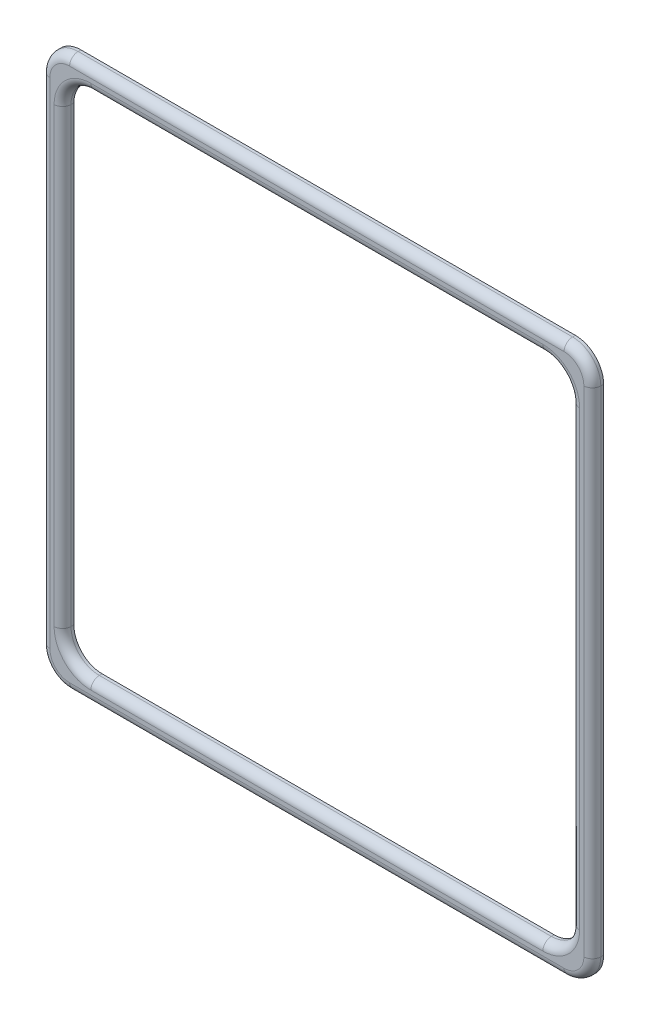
ISO-10303-21;
HEADER;
FILE_DESCRIPTION(('STEP AP214'),'2;1');
FILE_NAME('part.step','',(''),(''),'','','');
FILE_SCHEMA(('AUTOMOTIVE_DESIGN { 1 0 10303 214 1 1 1 1 }'));
ENDSEC;
DATA;
#1=APPLICATION_CONTEXT('core data for automotive mechanical design processes');
#2=APPLICATION_PROTOCOL_DEFINITION('international standard','automotive_design',2000,#1);
#3=PRODUCT_CONTEXT('',#1,'mechanical');
#4=PRODUCT('Part','Part','',(#3));
#5=PRODUCT_RELATED_PRODUCT_CATEGORY('part','',(#4));
#6=PRODUCT_DEFINITION_FORMATION('','',#4);
#7=PRODUCT_DEFINITION_CONTEXT('part definition',#1,'design');
#8=PRODUCT_DEFINITION('design','',#6,#7);
#9=PRODUCT_DEFINITION_SHAPE('','',#8);
#10=(LENGTH_UNIT() NAMED_UNIT(*) SI_UNIT(.MILLI.,.METRE.));
#11=(NAMED_UNIT(*) PLANE_ANGLE_UNIT() SI_UNIT($,.RADIAN.));
#12=(NAMED_UNIT(*) SI_UNIT($,.STERADIAN.) SOLID_ANGLE_UNIT());
#13=UNCERTAINTY_MEASURE_WITH_UNIT(LENGTH_MEASURE(1.E-05),#10,'distance_accuracy_value','');
#14=(GEOMETRIC_REPRESENTATION_CONTEXT(3) GLOBAL_UNCERTAINTY_ASSIGNED_CONTEXT((#13)) GLOBAL_UNIT_ASSIGNED_CONTEXT((#10,
#11,#12)) REPRESENTATION_CONTEXT('',''));
#15=CARTESIAN_POINT('',(0.,0.,0.));
#16=DIRECTION('',(0.,0.,1.));
#17=DIRECTION('',(1.,0.,0.));
#18=AXIS2_PLACEMENT_3D('',#15,#16,#17);
#19=CARTESIAN_POINT('',(20.,370.,8.));
#20=DIRECTION('',(0.,0.,-1.));
#21=DIRECTION('',(-1.,0.,0.));
#22=AXIS2_PLACEMENT_3D('',#19,#20,#21);
#23=PLANE('',#22);
#24=CARTESIAN_POINT('',(355.,35.,8.));
#25=DIRECTION('',(0.,0.,-1.));
#26=DIRECTION('',(-1.,0.,0.));
#27=AXIS2_PLACEMENT_3D('',#24,#25,#26);
#28=CIRCLE('',#27,26.);
#29=CARTESIAN_POINT('',(381.,35.,8.));
#30=VERTEX_POINT('',#29);
#31=CARTESIAN_POINT('',(355.,8.99999999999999,8.));
#32=VERTEX_POINT('',#31);
#33=EDGE_CURVE('E331',#30,#32,#28,.T.);
#34=ORIENTED_EDGE('',*,*,#33,.T.);
#35=DIRECTION('',(1.,0.,0.));
#36=VECTOR('',#35,1.);
#37=CARTESIAN_POINT('',(35.0000000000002,9.,8.));
#38=LINE('',#37,#36);
#39=CARTESIAN_POINT('',(35.0000000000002,9.,8.));
#40=VERTEX_POINT('',#39);
#41=EDGE_CURVE('E333',#32,#40,#38,.F.);
#42=ORIENTED_EDGE('',*,*,#41,.T.);
#43=CARTESIAN_POINT('',(35.0000000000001,35.,8.));
#44=DIRECTION('',(0.,0.,-1.));
#45=DIRECTION('',(-1.,0.,0.));
#46=AXIS2_PLACEMENT_3D('',#43,#44,#45);
#47=CIRCLE('',#46,26.);
#48=CARTESIAN_POINT('',(9.00000000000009,35.0000000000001,8.));
#49=VERTEX_POINT('',#48);
#50=EDGE_CURVE('E319',#40,#49,#47,.T.);
#51=ORIENTED_EDGE('',*,*,#50,.T.);
#52=DIRECTION('',(0.,-1.,0.));
#53=VECTOR('',#52,1.);
#54=CARTESIAN_POINT('',(9.,355.,8.));
#55=LINE('',#54,#53);
#56=CARTESIAN_POINT('',(9.,355.,8.));
#57=VERTEX_POINT('',#56);
#58=EDGE_CURVE('E321',#49,#57,#55,.F.);
#59=ORIENTED_EDGE('',*,*,#58,.T.);
#60=CARTESIAN_POINT('',(35.,355.,8.));
#61=DIRECTION('',(0.,0.,-1.));
#62=DIRECTION('',(-1.,0.,0.));
#63=AXIS2_PLACEMENT_3D('',#60,#61,#62);
#64=CIRCLE('',#63,26.);
#65=CARTESIAN_POINT('',(35.,381.,8.));
#66=VERTEX_POINT('',#65);
#67=EDGE_CURVE('E323',#57,#66,#64,.T.);
#68=ORIENTED_EDGE('',*,*,#67,.T.);
#69=DIRECTION('',(-1.,0.,0.));
#70=VECTOR('',#69,1.);
#71=CARTESIAN_POINT('',(355.,381.,8.));
#72=LINE('',#71,#70);
#73=CARTESIAN_POINT('',(355.,381.,8.));
#74=VERTEX_POINT('',#73);
#75=EDGE_CURVE('E325',#66,#74,#72,.F.);
#76=ORIENTED_EDGE('',*,*,#75,.T.);
#77=CARTESIAN_POINT('',(355.,355.,8.));
#78=DIRECTION('',(0.,0.,-1.));
#79=DIRECTION('',(-1.,0.,0.));
#80=AXIS2_PLACEMENT_3D('',#77,#78,#79);
#81=CIRCLE('',#80,26.);
#82=CARTESIAN_POINT('',(381.,355.,8.));
#83=VERTEX_POINT('',#82);
#84=EDGE_CURVE('E327',#74,#83,#81,.T.);
#85=ORIENTED_EDGE('',*,*,#84,.T.);
#86=DIRECTION('',(0.,1.,0.));
#87=VECTOR('',#86,1.);
#88=CARTESIAN_POINT('',(381.,35.,8.));
#89=LINE('',#88,#87);
#90=EDGE_CURVE('E329',#83,#30,#89,.F.);
#91=ORIENTED_EDGE('',*,*,#90,.T.);
#92=EDGE_LOOP('',(#34,#42,#51,#59,#68,#76,#85,#91));
#93=FACE_BOUND('',#92,.T.);
#94=CARTESIAN_POINT('',(370.,370.,8.));
#95=DIRECTION('',(0.,0.,-1.));
#96=DIRECTION('',(-1.,0.,0.));
#97=AXIS2_PLACEMENT_3D('',#94,#95,#96);
#98=CIRCLE('',#97,14.);
#99=CARTESIAN_POINT('',(384.,370.,8.));
#100=VERTEX_POINT('',#99);
#101=CARTESIAN_POINT('',(370.,384.,8.));
#102=VERTEX_POINT('',#101);
#103=EDGE_CURVE('E314',#100,#102,#98,.F.);
#104=ORIENTED_EDGE('',*,*,#103,.T.);
#105=DIRECTION('',(-1.,0.,0.));
#106=VECTOR('',#105,1.);
#107=CARTESIAN_POINT('',(20.,384.,8.));
#108=LINE('',#107,#106);
#109=CARTESIAN_POINT('',(20.,384.,8.));
#110=VERTEX_POINT('',#109);
#111=EDGE_CURVE('E316',#102,#110,#108,.T.);
#112=ORIENTED_EDGE('',*,*,#111,.T.);
#113=CARTESIAN_POINT('',(20.,370.,8.));
#114=DIRECTION('',(0.,0.,-1.));
#115=DIRECTION('',(-1.,0.,0.));
#116=AXIS2_PLACEMENT_3D('',#113,#114,#115);
#117=CIRCLE('',#116,14.);
#118=CARTESIAN_POINT('',(5.99999999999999,370.,8.));
#119=VERTEX_POINT('',#118);
#120=EDGE_CURVE('E302',#110,#119,#117,.F.);
#121=ORIENTED_EDGE('',*,*,#120,.T.);
#122=DIRECTION('',(0.,-1.,0.));
#123=VECTOR('',#122,1.);
#124=CARTESIAN_POINT('',(6.,370.,8.));
#125=LINE('',#124,#123);
#126=CARTESIAN_POINT('',(6.,20.0000000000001,8.));
#127=VERTEX_POINT('',#126);
#128=EDGE_CURVE('E304',#119,#127,#125,.T.);
#129=ORIENTED_EDGE('',*,*,#128,.T.);
#130=CARTESIAN_POINT('',(20.,20.,8.));
#131=DIRECTION('',(0.,0.,-1.));
#132=DIRECTION('',(-1.,0.,0.));
#133=AXIS2_PLACEMENT_3D('',#130,#131,#132);
#134=CIRCLE('',#133,14.);
#135=CARTESIAN_POINT('',(20.0000000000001,6.,8.));
#136=VERTEX_POINT('',#135);
#137=EDGE_CURVE('E306',#127,#136,#134,.F.);
#138=ORIENTED_EDGE('',*,*,#137,.T.);
#139=DIRECTION('',(1.,0.,0.));
#140=VECTOR('',#139,1.);
#141=CARTESIAN_POINT('',(20.,6.00000000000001,8.));
#142=LINE('',#141,#140);
#143=CARTESIAN_POINT('',(370.,6.00000000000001,8.));
#144=VERTEX_POINT('',#143);
#145=EDGE_CURVE('E308',#136,#144,#142,.T.);
#146=ORIENTED_EDGE('',*,*,#145,.T.);
#147=CARTESIAN_POINT('',(370.,20.,8.));
#148=DIRECTION('',(0.,0.,-1.));
#149=DIRECTION('',(-1.,0.,0.));
#150=AXIS2_PLACEMENT_3D('',#147,#148,#149);
#151=CIRCLE('',#150,14.);
#152=CARTESIAN_POINT('',(384.,20.,8.));
#153=VERTEX_POINT('',#152);
#154=EDGE_CURVE('E310',#144,#153,#151,.F.);
#155=ORIENTED_EDGE('',*,*,#154,.T.);
#156=DIRECTION('',(0.,1.,0.));
#157=VECTOR('',#156,1.);
#158=CARTESIAN_POINT('',(384.,370.,8.));
#159=LINE('',#158,#157);
#160=EDGE_CURVE('E312',#153,#100,#159,.T.);
#161=ORIENTED_EDGE('',*,*,#160,.T.);
#162=EDGE_LOOP('',(#104,#112,#121,#129,#138,#146,#155,#161));
#163=FACE_BOUND('',#162,.T.);
#164=ADVANCED_FACE('F39',(#93,#163),#23,.F.);
#165=CARTESIAN_POINT('',(20.,370.,0.));
#166=DIRECTION('',(0.,0.,-1.));
#167=DIRECTION('',(-1.,0.,0.));
#168=AXIS2_PLACEMENT_3D('',#165,#166,#167);
#169=PLANE('',#168);
#170=CARTESIAN_POINT('',(20.,370.,0.));
#171=DIRECTION('',(0.,0.,1.));
#172=DIRECTION('',(-1.,0.,0.));
#173=AXIS2_PLACEMENT_3D('',#170,#171,#172);
#174=CIRCLE('',#173,20.);
#175=CARTESIAN_POINT('',(20.,390.,0.));
#176=VERTEX_POINT('',#175);
#177=CARTESIAN_POINT('',(0.,370.,0.));
#178=VERTEX_POINT('',#177);
#179=EDGE_CURVE('E213',#176,#178,#174,.T.);
#180=ORIENTED_EDGE('',*,*,#179,.F.);
#181=DIRECTION('',(-1.,0.,0.));
#182=VECTOR('',#181,1.);
#183=CARTESIAN_POINT('',(20.,390.,0.));
#184=LINE('',#183,#182);
#185=CARTESIAN_POINT('',(370.,390.,0.));
#186=VERTEX_POINT('',#185);
#187=EDGE_CURVE('E281',#186,#176,#184,.T.);
#188=ORIENTED_EDGE('',*,*,#187,.F.);
#189=CARTESIAN_POINT('',(370.,370.,0.));
#190=DIRECTION('',(0.,0.,1.));
#191=DIRECTION('',(-1.,0.,0.));
#192=AXIS2_PLACEMENT_3D('',#189,#190,#191);
#193=CIRCLE('',#192,20.);
#194=CARTESIAN_POINT('',(390.,370.,0.));
#195=VERTEX_POINT('',#194);
#196=EDGE_CURVE('E278',#195,#186,#193,.T.);
#197=ORIENTED_EDGE('',*,*,#196,.F.);
#198=DIRECTION('',(0.,1.,0.));
#199=VECTOR('',#198,1.);
#200=CARTESIAN_POINT('',(390.,20.,0.));
#201=LINE('',#200,#199);
#202=CARTESIAN_POINT('',(390.,20.,0.));
#203=VERTEX_POINT('',#202);
#204=EDGE_CURVE('E275',#203,#195,#201,.T.);
#205=ORIENTED_EDGE('',*,*,#204,.F.);
#206=CARTESIAN_POINT('',(370.,20.,0.));
#207=DIRECTION('',(0.,0.,1.));
#208=DIRECTION('',(1.,0.,0.));
#209=AXIS2_PLACEMENT_3D('',#206,#207,#208);
#210=CIRCLE('',#209,20.);
#211=CARTESIAN_POINT('',(370.,0.,0.));
#212=VERTEX_POINT('',#211);
#213=EDGE_CURVE('E272',#212,#203,#210,.T.);
#214=ORIENTED_EDGE('',*,*,#213,.F.);
#215=DIRECTION('',(1.,0.,0.));
#216=VECTOR('',#215,1.);
#217=CARTESIAN_POINT('',(20.0000000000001,0.,0.));
#218=LINE('',#217,#216);
#219=CARTESIAN_POINT('',(20.0000000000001,0.,0.));
#220=VERTEX_POINT('',#219);
#221=EDGE_CURVE('E269',#220,#212,#218,.T.);
#222=ORIENTED_EDGE('',*,*,#221,.F.);
#223=CARTESIAN_POINT('',(20.,20.,0.));
#224=DIRECTION('',(0.,0.,1.));
#225=DIRECTION('',(-1.,0.,0.));
#226=AXIS2_PLACEMENT_3D('',#223,#224,#225);
#227=CIRCLE('',#226,20.);
#228=CARTESIAN_POINT('',(0.,20.0000000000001,0.));
#229=VERTEX_POINT('',#228);
#230=EDGE_CURVE('E266',#229,#220,#227,.T.);
#231=ORIENTED_EDGE('',*,*,#230,.F.);
#232=DIRECTION('',(0.,-1.,0.));
#233=VECTOR('',#232,1.);
#234=CARTESIAN_POINT('',(0.,20.0000000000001,0.));
#235=LINE('',#234,#233);
#236=EDGE_CURVE('E263',#178,#229,#235,.T.);
#237=ORIENTED_EDGE('',*,*,#236,.F.);
#238=EDGE_LOOP('',(#180,#188,#197,#205,#214,#222,#231,#237));
#239=FACE_BOUND('',#238,.T.);
#240=DIRECTION('',(0.,-1.,0.));
#241=VECTOR('',#240,1.);
#242=CARTESIAN_POINT('',(15.,355.,0.));
#243=LINE('',#242,#241);
#244=CARTESIAN_POINT('',(15.,355.,0.));
#245=VERTEX_POINT('',#244);
#246=CARTESIAN_POINT('',(15.0000000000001,35.0000000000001,0.));
#247=VERTEX_POINT('',#246);
#248=EDGE_CURVE('E228',#245,#247,#243,.T.);
#249=ORIENTED_EDGE('',*,*,#248,.T.);
#250=CARTESIAN_POINT('',(35.0000000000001,35.,0.));
#251=DIRECTION('',(0.,0.,1.));
#252=DIRECTION('',(1.,0.,0.));
#253=AXIS2_PLACEMENT_3D('',#250,#251,#252);
#254=CIRCLE('',#253,20.);
#255=CARTESIAN_POINT('',(35.0000000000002,15.,0.));
#256=VERTEX_POINT('',#255);
#257=EDGE_CURVE('E206',#247,#256,#254,.T.);
#258=ORIENTED_EDGE('',*,*,#257,.T.);
#259=DIRECTION('',(1.,0.,0.));
#260=VECTOR('',#259,1.);
#261=CARTESIAN_POINT('',(35.0000000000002,15.,0.));
#262=LINE('',#261,#260);
#263=CARTESIAN_POINT('',(355.,15.,0.));
#264=VERTEX_POINT('',#263);
#265=EDGE_CURVE('E217',#256,#264,#262,.T.);
#266=ORIENTED_EDGE('',*,*,#265,.T.);
#267=CARTESIAN_POINT('',(355.,35.,0.));
#268=DIRECTION('',(0.,0.,1.));
#269=DIRECTION('',(1.,0.,0.));
#270=AXIS2_PLACEMENT_3D('',#267,#268,#269);
#271=CIRCLE('',#270,20.);
#272=CARTESIAN_POINT('',(375.,35.,0.));
#273=VERTEX_POINT('',#272);
#274=EDGE_CURVE('E223',#264,#273,#271,.T.);
#275=ORIENTED_EDGE('',*,*,#274,.T.);
#276=DIRECTION('',(0.,1.,0.));
#277=VECTOR('',#276,1.);
#278=CARTESIAN_POINT('',(375.,355.,0.));
#279=LINE('',#278,#277);
#280=CARTESIAN_POINT('',(375.,355.,0.));
#281=VERTEX_POINT('',#280);
#282=EDGE_CURVE('E236',#273,#281,#279,.T.);
#283=ORIENTED_EDGE('',*,*,#282,.T.);
#284=CARTESIAN_POINT('',(355.,355.,0.));
#285=DIRECTION('',(0.,0.,1.));
#286=DIRECTION('',(-1.,0.,0.));
#287=AXIS2_PLACEMENT_3D('',#284,#285,#286);
#288=CIRCLE('',#287,20.);
#289=CARTESIAN_POINT('',(355.,375.,0.));
#290=VERTEX_POINT('',#289);
#291=EDGE_CURVE('E239',#281,#290,#288,.T.);
#292=ORIENTED_EDGE('',*,*,#291,.T.);
#293=DIRECTION('',(-1.,0.,0.));
#294=VECTOR('',#293,1.);
#295=CARTESIAN_POINT('',(35.,375.,0.));
#296=LINE('',#295,#294);
#297=CARTESIAN_POINT('',(35.,375.,0.));
#298=VERTEX_POINT('',#297);
#299=EDGE_CURVE('E242',#290,#298,#296,.T.);
#300=ORIENTED_EDGE('',*,*,#299,.T.);
#301=CARTESIAN_POINT('',(35.,355.,0.));
#302=DIRECTION('',(0.,0.,1.));
#303=DIRECTION('',(1.,0.,0.));
#304=AXIS2_PLACEMENT_3D('',#301,#302,#303);
#305=CIRCLE('',#304,20.);
#306=EDGE_CURVE('E245',#298,#245,#305,.T.);
#307=ORIENTED_EDGE('',*,*,#306,.T.);
#308=EDGE_LOOP('',(#249,#258,#266,#275,#283,#292,#300,#307));
#309=FACE_BOUND('',#308,.T.);
#310=ADVANCED_FACE('F225',(#239,#309),#169,.T.);
#311=CARTESIAN_POINT('',(20.,370.,8.));
#312=DIRECTION('',(0.,0.,-1.));
#313=DIRECTION('',(-1.,0.,0.));
#314=AXIS2_PLACEMENT_3D('',#311,#312,#313);
#315=CYLINDRICAL_SURFACE('',#314,20.);
#316=DIRECTION('',(0.,0.,-1.));
#317=VECTOR('',#316,1.);
#318=CARTESIAN_POINT('',(0.,370.,8.));
#319=LINE('',#318,#317);
#320=CARTESIAN_POINT('',(0.,370.,2.));
#321=VERTEX_POINT('',#320);
#322=EDGE_CURVE('E298',#321,#178,#319,.T.);
#323=ORIENTED_EDGE('',*,*,#322,.F.);
#324=CARTESIAN_POINT('',(20.,370.,2.));
#325=DIRECTION('',(0.,0.,-1.));
#326=DIRECTION('',(-1.,0.,0.));
#327=AXIS2_PLACEMENT_3D('',#324,#325,#326);
#328=CIRCLE('',#327,20.);
#329=CARTESIAN_POINT('',(20.,390.,2.));
#330=VERTEX_POINT('',#329);
#331=EDGE_CURVE('E11',#321,#330,#328,.T.);
#332=ORIENTED_EDGE('',*,*,#331,.T.);
#333=DIRECTION('',(0.,0.,-1.));
#334=VECTOR('',#333,1.);
#335=CARTESIAN_POINT('',(20.,390.,8.));
#336=LINE('',#335,#334);
#337=EDGE_CURVE('E284',#330,#176,#336,.T.);
#338=ORIENTED_EDGE('',*,*,#337,.T.);
#339=ORIENTED_EDGE('',*,*,#179,.T.);
#340=EDGE_LOOP('',(#323,#332,#338,#339));
#341=FACE_BOUND('',#340,.T.);
#342=ADVANCED_FACE('F453',(#341),#315,.T.);
#343=CARTESIAN_POINT('',(0.,20.0000000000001,8.));
#344=DIRECTION('',(1.,0.,0.));
#345=DIRECTION('',(0.,0.,-1.));
#346=AXIS2_PLACEMENT_3D('',#343,#344,#345);
#347=PLANE('',#346);
#348=DIRECTION('',(0.,0.,-1.));
#349=VECTOR('',#348,1.);
#350=CARTESIAN_POINT('',(0.,20.0000000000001,8.));
#351=LINE('',#350,#349);
#352=CARTESIAN_POINT('',(0.,20.0000000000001,2.));
#353=VERTEX_POINT('',#352);
#354=EDGE_CURVE('E296',#353,#229,#351,.T.);
#355=ORIENTED_EDGE('',*,*,#354,.F.);
#356=DIRECTION('',(0.,-1.,0.));
#357=VECTOR('',#356,1.);
#358=CARTESIAN_POINT('',(0.,20.0000000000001,2.));
#359=LINE('',#358,#357);
#360=EDGE_CURVE('E48',#353,#321,#359,.F.);
#361=ORIENTED_EDGE('',*,*,#360,.T.);
#362=ORIENTED_EDGE('',*,*,#322,.T.);
#363=ORIENTED_EDGE('',*,*,#236,.T.);
#364=EDGE_LOOP('',(#355,#361,#362,#363));
#365=FACE_BOUND('',#364,.T.);
#366=ADVANCED_FACE('F493',(#365),#347,.F.);
#367=CARTESIAN_POINT('',(20.,20.,8.));
#368=DIRECTION('',(0.,0.,-1.));
#369=DIRECTION('',(-1.,0.,0.));
#370=AXIS2_PLACEMENT_3D('',#367,#368,#369);
#371=CYLINDRICAL_SURFACE('',#370,20.);
#372=DIRECTION('',(0.,0.,-1.));
#373=VECTOR('',#372,1.);
#374=CARTESIAN_POINT('',(20.0000000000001,0.,8.));
#375=LINE('',#374,#373);
#376=CARTESIAN_POINT('',(20.0000000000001,0.,2.));
#377=VERTEX_POINT('',#376);
#378=EDGE_CURVE('E294',#377,#220,#375,.T.);
#379=ORIENTED_EDGE('',*,*,#378,.F.);
#380=CARTESIAN_POINT('',(20.,20.,2.));
#381=DIRECTION('',(0.,0.,-1.));
#382=DIRECTION('',(-1.,0.,0.));
#383=AXIS2_PLACEMENT_3D('',#380,#381,#382);
#384=CIRCLE('',#383,20.);
#385=EDGE_CURVE('E63',#377,#353,#384,.T.);
#386=ORIENTED_EDGE('',*,*,#385,.T.);
#387=ORIENTED_EDGE('',*,*,#354,.T.);
#388=ORIENTED_EDGE('',*,*,#230,.T.);
#389=EDGE_LOOP('',(#379,#386,#387,#388));
#390=FACE_BOUND('',#389,.T.);
#391=ADVANCED_FACE('F413',(#390),#371,.T.);
#392=CARTESIAN_POINT('',(20.0000000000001,0.,8.));
#393=DIRECTION('',(0.,1.,0.));
#394=DIRECTION('',(0.,0.,1.));
#395=AXIS2_PLACEMENT_3D('',#392,#393,#394);
#396=PLANE('',#395);
#397=DIRECTION('',(0.,0.,-1.));
#398=VECTOR('',#397,1.);
#399=CARTESIAN_POINT('',(370.,0.,8.));
#400=LINE('',#399,#398);
#401=CARTESIAN_POINT('',(370.,0.,2.));
#402=VERTEX_POINT('',#401);
#403=EDGE_CURVE('E292',#402,#212,#400,.T.);
#404=ORIENTED_EDGE('',*,*,#403,.F.);
#405=DIRECTION('',(1.,0.,0.));
#406=VECTOR('',#405,1.);
#407=CARTESIAN_POINT('',(20.0000000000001,0.,2.));
#408=LINE('',#407,#406);
#409=EDGE_CURVE('E358',#402,#377,#408,.F.);
#410=ORIENTED_EDGE('',*,*,#409,.T.);
#411=ORIENTED_EDGE('',*,*,#378,.T.);
#412=ORIENTED_EDGE('',*,*,#221,.T.);
#413=EDGE_LOOP('',(#404,#410,#411,#412));
#414=FACE_BOUND('',#413,.T.);
#415=ADVANCED_FACE('F412',(#414),#396,.F.);
#416=CARTESIAN_POINT('',(370.,20.,8.));
#417=DIRECTION('',(0.,0.,-1.));
#418=DIRECTION('',(-1.,0.,0.));
#419=AXIS2_PLACEMENT_3D('',#416,#417,#418);
#420=CYLINDRICAL_SURFACE('',#419,20.);
#421=DIRECTION('',(0.,0.,-1.));
#422=VECTOR('',#421,1.);
#423=CARTESIAN_POINT('',(390.,20.,8.));
#424=LINE('',#423,#422);
#425=CARTESIAN_POINT('',(390.,20.,2.));
#426=VERTEX_POINT('',#425);
#427=EDGE_CURVE('E290',#426,#203,#424,.T.);
#428=ORIENTED_EDGE('',*,*,#427,.F.);
#429=CARTESIAN_POINT('',(370.,20.,2.));
#430=DIRECTION('',(0.,0.,-1.));
#431=DIRECTION('',(-1.,0.,0.));
#432=AXIS2_PLACEMENT_3D('',#429,#430,#431);
#433=CIRCLE('',#432,20.);
#434=EDGE_CURVE('E356',#426,#402,#433,.T.);
#435=ORIENTED_EDGE('',*,*,#434,.T.);
#436=ORIENTED_EDGE('',*,*,#403,.T.);
#437=ORIENTED_EDGE('',*,*,#213,.T.);
#438=EDGE_LOOP('',(#428,#435,#436,#437));
#439=FACE_BOUND('',#438,.T.);
#440=ADVANCED_FACE('F424',(#439),#420,.T.);
#441=CARTESIAN_POINT('',(390.,20.,8.));
#442=DIRECTION('',(-1.,0.,0.));
#443=DIRECTION('',(0.,0.,1.));
#444=AXIS2_PLACEMENT_3D('',#441,#442,#443);
#445=PLANE('',#444);
#446=DIRECTION('',(0.,0.,-1.));
#447=VECTOR('',#446,1.);
#448=CARTESIAN_POINT('',(390.,370.,8.));
#449=LINE('',#448,#447);
#450=CARTESIAN_POINT('',(390.,370.,2.));
#451=VERTEX_POINT('',#450);
#452=EDGE_CURVE('E288',#451,#195,#449,.T.);
#453=ORIENTED_EDGE('',*,*,#452,.F.);
#454=DIRECTION('',(0.,1.,0.));
#455=VECTOR('',#454,1.);
#456=CARTESIAN_POINT('',(390.,20.,2.));
#457=LINE('',#456,#455);
#458=EDGE_CURVE('E354',#451,#426,#457,.F.);
#459=ORIENTED_EDGE('',*,*,#458,.T.);
#460=ORIENTED_EDGE('',*,*,#427,.T.);
#461=ORIENTED_EDGE('',*,*,#204,.T.);
#462=EDGE_LOOP('',(#453,#459,#460,#461));
#463=FACE_BOUND('',#462,.T.);
#464=ADVANCED_FACE('F427',(#463),#445,.F.);
#465=CARTESIAN_POINT('',(370.,370.,8.));
#466=DIRECTION('',(0.,0.,-1.));
#467=DIRECTION('',(-1.,0.,0.));
#468=AXIS2_PLACEMENT_3D('',#465,#466,#467);
#469=CYLINDRICAL_SURFACE('',#468,20.);
#470=DIRECTION('',(0.,0.,-1.));
#471=VECTOR('',#470,1.);
#472=CARTESIAN_POINT('',(370.,390.,8.));
#473=LINE('',#472,#471);
#474=CARTESIAN_POINT('',(370.,390.,2.));
#475=VERTEX_POINT('',#474);
#476=EDGE_CURVE('E286',#475,#186,#473,.T.);
#477=ORIENTED_EDGE('',*,*,#476,.F.);
#478=CARTESIAN_POINT('',(370.,370.,2.));
#479=DIRECTION('',(0.,0.,-1.));
#480=DIRECTION('',(-1.,0.,0.));
#481=AXIS2_PLACEMENT_3D('',#478,#479,#480);
#482=CIRCLE('',#481,20.);
#483=EDGE_CURVE('E352',#475,#451,#482,.T.);
#484=ORIENTED_EDGE('',*,*,#483,.T.);
#485=ORIENTED_EDGE('',*,*,#452,.T.);
#486=ORIENTED_EDGE('',*,*,#196,.T.);
#487=EDGE_LOOP('',(#477,#484,#485,#486));
#488=FACE_BOUND('',#487,.T.);
#489=ADVANCED_FACE('F481',(#488),#469,.T.);
#490=CARTESIAN_POINT('',(20.,390.,8.));
#491=DIRECTION('',(0.,-1.,0.));
#492=DIRECTION('',(0.,0.,-1.));
#493=AXIS2_PLACEMENT_3D('',#490,#491,#492);
#494=PLANE('',#493);
#495=ORIENTED_EDGE('',*,*,#337,.F.);
#496=DIRECTION('',(-1.,0.,0.));
#497=VECTOR('',#496,1.);
#498=CARTESIAN_POINT('',(20.,390.,2.));
#499=LINE('',#498,#497);
#500=EDGE_CURVE('E349',#330,#475,#499,.F.);
#501=ORIENTED_EDGE('',*,*,#500,.T.);
#502=ORIENTED_EDGE('',*,*,#476,.T.);
#503=ORIENTED_EDGE('',*,*,#187,.T.);
#504=EDGE_LOOP('',(#495,#501,#502,#503));
#505=FACE_BOUND('',#504,.T.);
#506=ADVANCED_FACE('F456',(#505),#494,.F.);
#507=CARTESIAN_POINT('',(35.0000000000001,35.,8.));
#508=DIRECTION('',(0.,0.,-1.));
#509=DIRECTION('',(-1.,0.,0.));
#510=AXIS2_PLACEMENT_3D('',#507,#508,#509);
#511=CYLINDRICAL_SURFACE('',#510,20.);
#512=DIRECTION('',(0.,0.,-1.));
#513=VECTOR('',#512,1.);
#514=CARTESIAN_POINT('',(15.0000000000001,35.0000000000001,8.));
#515=LINE('',#514,#513);
#516=CARTESIAN_POINT('',(15.0000000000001,35.0000000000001,2.));
#517=VERTEX_POINT('',#516);
#518=EDGE_CURVE('E248',#517,#247,#515,.T.);
#519=ORIENTED_EDGE('',*,*,#518,.F.);
#520=CARTESIAN_POINT('',(35.0000000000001,35.,2.));
#521=DIRECTION('',(0.,0.,-1.));
#522=DIRECTION('',(-1.,0.,0.));
#523=AXIS2_PLACEMENT_3D('',#520,#521,#522);
#524=CIRCLE('',#523,20.);
#525=CARTESIAN_POINT('',(35.0000000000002,15.,2.));
#526=VERTEX_POINT('',#525);
#527=EDGE_CURVE('E209',#517,#526,#524,.F.);
#528=ORIENTED_EDGE('',*,*,#527,.T.);
#529=DIRECTION('',(0.,0.,-1.));
#530=VECTOR('',#529,1.);
#531=CARTESIAN_POINT('',(35.0000000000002,15.,8.));
#532=LINE('',#531,#530);
#533=EDGE_CURVE('E201',#526,#256,#532,.T.);
#534=ORIENTED_EDGE('',*,*,#533,.T.);
#535=ORIENTED_EDGE('',*,*,#257,.F.);
#536=EDGE_LOOP('',(#519,#528,#534,#535));
#537=FACE_BOUND('',#536,.T.);
#538=ADVANCED_FACE('F204',(#537),#511,.F.);
#539=CARTESIAN_POINT('',(35.0000000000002,15.,8.));
#540=DIRECTION('',(0.,1.,0.));
#541=DIRECTION('',(0.,0.,1.));
#542=AXIS2_PLACEMENT_3D('',#539,#540,#541);
#543=PLANE('',#542);
#544=ORIENTED_EDGE('',*,*,#533,.F.);
#545=DIRECTION('',(1.,0.,0.));
#546=VECTOR('',#545,1.);
#547=CARTESIAN_POINT('',(355.,15.,2.));
#548=LINE('',#547,#546);
#549=CARTESIAN_POINT('',(355.,15.,2.));
#550=VERTEX_POINT('',#549);
#551=EDGE_CURVE('E300',#526,#550,#548,.T.);
#552=ORIENTED_EDGE('',*,*,#551,.T.);
#553=DIRECTION('',(0.,0.,-1.));
#554=VECTOR('',#553,1.);
#555=CARTESIAN_POINT('',(355.,15.,8.));
#556=LINE('',#555,#554);
#557=EDGE_CURVE('E214',#550,#264,#556,.T.);
#558=ORIENTED_EDGE('',*,*,#557,.T.);
#559=ORIENTED_EDGE('',*,*,#265,.F.);
#560=EDGE_LOOP('',(#544,#552,#558,#559));
#561=FACE_BOUND('',#560,.T.);
#562=ADVANCED_FACE('F218',(#561),#543,.T.);
#563=CARTESIAN_POINT('',(355.,35.,8.));
#564=DIRECTION('',(0.,0.,-1.));
#565=DIRECTION('',(-1.,0.,0.));
#566=AXIS2_PLACEMENT_3D('',#563,#564,#565);
#567=CYLINDRICAL_SURFACE('',#566,20.);
#568=ORIENTED_EDGE('',*,*,#557,.F.);
#569=CARTESIAN_POINT('',(355.,35.,2.));
#570=DIRECTION('',(0.,0.,-1.));
#571=DIRECTION('',(-1.,0.,0.));
#572=AXIS2_PLACEMENT_3D('',#569,#570,#571);
#573=CIRCLE('',#572,20.);
#574=CARTESIAN_POINT('',(375.,35.,2.));
#575=VERTEX_POINT('',#574);
#576=EDGE_CURVE('E336',#550,#575,#573,.F.);
#577=ORIENTED_EDGE('',*,*,#576,.T.);
#578=DIRECTION('',(0.,0.,-1.));
#579=VECTOR('',#578,1.);
#580=CARTESIAN_POINT('',(375.,35.,8.));
#581=LINE('',#580,#579);
#582=EDGE_CURVE('E258',#575,#273,#581,.T.);
#583=ORIENTED_EDGE('',*,*,#582,.T.);
#584=ORIENTED_EDGE('',*,*,#274,.F.);
#585=EDGE_LOOP('',(#568,#577,#583,#584));
#586=FACE_BOUND('',#585,.T.);
#587=ADVANCED_FACE('F569',(#586),#567,.F.);
#588=CARTESIAN_POINT('',(375.,355.,8.));
#589=DIRECTION('',(-1.,0.,0.));
#590=DIRECTION('',(0.,-1.,0.));
#591=AXIS2_PLACEMENT_3D('',#588,#589,#590);
#592=PLANE('',#591);
#593=ORIENTED_EDGE('',*,*,#582,.F.);
#594=DIRECTION('',(0.,1.,0.));
#595=VECTOR('',#594,1.);
#596=CARTESIAN_POINT('',(375.,355.,2.));
#597=LINE('',#596,#595);
#598=CARTESIAN_POINT('',(375.,355.,2.));
#599=VERTEX_POINT('',#598);
#600=EDGE_CURVE('E338',#575,#599,#597,.T.);
#601=ORIENTED_EDGE('',*,*,#600,.T.);
#602=DIRECTION('',(0.,0.,-1.));
#603=VECTOR('',#602,1.);
#604=CARTESIAN_POINT('',(375.,355.,8.));
#605=LINE('',#604,#603);
#606=EDGE_CURVE('E256',#599,#281,#605,.T.);
#607=ORIENTED_EDGE('',*,*,#606,.T.);
#608=ORIENTED_EDGE('',*,*,#282,.F.);
#609=EDGE_LOOP('',(#593,#601,#607,#608));
#610=FACE_BOUND('',#609,.T.);
#611=ADVANCED_FACE('F573',(#610),#592,.T.);
#612=CARTESIAN_POINT('',(355.,355.,8.));
#613=DIRECTION('',(0.,0.,-1.));
#614=DIRECTION('',(-1.,0.,0.));
#615=AXIS2_PLACEMENT_3D('',#612,#613,#614);
#616=CYLINDRICAL_SURFACE('',#615,20.);
#617=ORIENTED_EDGE('',*,*,#606,.F.);
#618=CARTESIAN_POINT('',(355.,355.,2.));
#619=DIRECTION('',(0.,0.,-1.));
#620=DIRECTION('',(-1.,0.,0.));
#621=AXIS2_PLACEMENT_3D('',#618,#619,#620);
#622=CIRCLE('',#621,20.);
#623=CARTESIAN_POINT('',(355.,375.,2.));
#624=VERTEX_POINT('',#623);
#625=EDGE_CURVE('E340',#599,#624,#622,.F.);
#626=ORIENTED_EDGE('',*,*,#625,.T.);
#627=DIRECTION('',(0.,0.,-1.));
#628=VECTOR('',#627,1.);
#629=CARTESIAN_POINT('',(355.,375.,8.));
#630=LINE('',#629,#628);
#631=EDGE_CURVE('E254',#624,#290,#630,.T.);
#632=ORIENTED_EDGE('',*,*,#631,.T.);
#633=ORIENTED_EDGE('',*,*,#291,.F.);
#634=EDGE_LOOP('',(#617,#626,#632,#633));
#635=FACE_BOUND('',#634,.T.);
#636=ADVANCED_FACE('F560',(#635),#616,.F.);
#637=CARTESIAN_POINT('',(35.,375.,8.));
#638=DIRECTION('',(0.,-1.,0.));
#639=DIRECTION('',(0.,0.,-1.));
#640=AXIS2_PLACEMENT_3D('',#637,#638,#639);
#641=PLANE('',#640);
#642=ORIENTED_EDGE('',*,*,#631,.F.);
#643=DIRECTION('',(-1.,0.,0.));
#644=VECTOR('',#643,1.);
#645=CARTESIAN_POINT('',(35.,375.,2.));
#646=LINE('',#645,#644);
#647=CARTESIAN_POINT('',(35.,375.,2.));
#648=VERTEX_POINT('',#647);
#649=EDGE_CURVE('E342',#624,#648,#646,.T.);
#650=ORIENTED_EDGE('',*,*,#649,.T.);
#651=DIRECTION('',(0.,0.,-1.));
#652=VECTOR('',#651,1.);
#653=CARTESIAN_POINT('',(35.,375.,8.));
#654=LINE('',#653,#652);
#655=EDGE_CURVE('E252',#648,#298,#654,.T.);
#656=ORIENTED_EDGE('',*,*,#655,.T.);
#657=ORIENTED_EDGE('',*,*,#299,.F.);
#658=EDGE_LOOP('',(#642,#650,#656,#657));
#659=FACE_BOUND('',#658,.T.);
#660=ADVANCED_FACE('F556',(#659),#641,.T.);
#661=CARTESIAN_POINT('',(35.,355.,8.));
#662=DIRECTION('',(0.,0.,-1.));
#663=DIRECTION('',(-1.,0.,0.));
#664=AXIS2_PLACEMENT_3D('',#661,#662,#663);
#665=CYLINDRICAL_SURFACE('',#664,20.);
#666=ORIENTED_EDGE('',*,*,#655,.F.);
#667=CARTESIAN_POINT('',(35.,355.,2.));
#668=DIRECTION('',(0.,0.,-1.));
#669=DIRECTION('',(-1.,0.,0.));
#670=AXIS2_PLACEMENT_3D('',#667,#668,#669);
#671=CIRCLE('',#670,20.);
#672=CARTESIAN_POINT('',(15.,355.,2.));
#673=VERTEX_POINT('',#672);
#674=EDGE_CURVE('E344',#648,#673,#671,.F.);
#675=ORIENTED_EDGE('',*,*,#674,.T.);
#676=DIRECTION('',(0.,0.,-1.));
#677=VECTOR('',#676,1.);
#678=CARTESIAN_POINT('',(15.,355.,8.));
#679=LINE('',#678,#677);
#680=EDGE_CURVE('E250',#673,#245,#679,.T.);
#681=ORIENTED_EDGE('',*,*,#680,.T.);
#682=ORIENTED_EDGE('',*,*,#306,.F.);
#683=EDGE_LOOP('',(#666,#675,#681,#682));
#684=FACE_BOUND('',#683,.T.);
#685=ADVANCED_FACE('F531',(#684),#665,.F.);
#686=CARTESIAN_POINT('',(15.,355.,8.));
#687=DIRECTION('',(1.,0.,0.));
#688=DIRECTION('',(0.,1.,0.));
#689=AXIS2_PLACEMENT_3D('',#686,#687,#688);
#690=PLANE('',#689);
#691=ORIENTED_EDGE('',*,*,#680,.F.);
#692=DIRECTION('',(0.,-1.,0.));
#693=VECTOR('',#692,1.);
#694=CARTESIAN_POINT('',(15.0000000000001,35.0000000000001,2.));
#695=LINE('',#694,#693);
#696=EDGE_CURVE('E346',#673,#517,#695,.T.);
#697=ORIENTED_EDGE('',*,*,#696,.T.);
#698=ORIENTED_EDGE('',*,*,#518,.T.);
#699=ORIENTED_EDGE('',*,*,#248,.F.);
#700=EDGE_LOOP('',(#691,#697,#698,#699));
#701=FACE_BOUND('',#700,.T.);
#702=ADVANCED_FACE('F526',(#701),#690,.T.);
#703=CARTESIAN_POINT('',(35.,381.,2.));
#704=DIRECTION('',(1.,0.,0.));
#705=DIRECTION('',(0.,0.,-1.));
#706=AXIS2_PLACEMENT_3D('',#703,#704,#705);
#707=CYLINDRICAL_SURFACE('',#706,6.);
#708=CARTESIAN_POINT('',(355.,381.,2.));
#709=DIRECTION('',(1.,0.,0.));
#710=DIRECTION('',(0.,0.,-1.));
#711=AXIS2_PLACEMENT_3D('',#708,#709,#710);
#712=CIRCLE('',#711,6.);
#713=EDGE_CURVE('E232',#74,#624,#712,.T.);
#714=ORIENTED_EDGE('',*,*,#713,.F.);
#715=ORIENTED_EDGE('',*,*,#75,.F.);
#716=CARTESIAN_POINT('',(35.,381.,2.));
#717=DIRECTION('',(-1.,0.,0.));
#718=DIRECTION('',(0.,0.,1.));
#719=AXIS2_PLACEMENT_3D('',#716,#717,#718);
#720=CIRCLE('',#719,6.);
#721=EDGE_CURVE('E229',#648,#66,#720,.T.);
#722=ORIENTED_EDGE('',*,*,#721,.F.);
#723=ORIENTED_EDGE('',*,*,#649,.F.);
#724=EDGE_LOOP('',(#714,#715,#722,#723));
#725=FACE_BOUND('',#724,.T.);
#726=ADVANCED_FACE('F523',(#725),#707,.T.);
#727=CARTESIAN_POINT('',(35.,355.,2.));
#728=DIRECTION('',(0.,0.,-1.));
#729=DIRECTION('',(-1.,0.,0.));
#730=AXIS2_PLACEMENT_3D('',#727,#728,#729);
#731=TOROIDAL_SURFACE('',#730,26.,6.);
#732=ORIENTED_EDGE('',*,*,#721,.T.);
#733=ORIENTED_EDGE('',*,*,#67,.F.);
#734=CARTESIAN_POINT('',(8.99999999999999,355.,2.));
#735=DIRECTION('',(0.,-1.,0.));
#736=DIRECTION('',(0.,0.,-1.));
#737=AXIS2_PLACEMENT_3D('',#734,#735,#736);
#738=CIRCLE('',#737,6.);
#739=EDGE_CURVE('E375',#673,#57,#738,.T.);
#740=ORIENTED_EDGE('',*,*,#739,.F.);
#741=ORIENTED_EDGE('',*,*,#674,.F.);
#742=EDGE_LOOP('',(#732,#733,#740,#741));
#743=FACE_BOUND('',#742,.T.);
#744=ADVANCED_FACE('F520',(#743),#731,.T.);
#745=CARTESIAN_POINT('',(355.,355.,2.));
#746=DIRECTION('',(0.,0.,-1.));
#747=DIRECTION('',(-1.,0.,0.));
#748=AXIS2_PLACEMENT_3D('',#745,#746,#747);
#749=TOROIDAL_SURFACE('',#748,26.,6.);
#750=ORIENTED_EDGE('',*,*,#713,.T.);
#751=ORIENTED_EDGE('',*,*,#625,.F.);
#752=CARTESIAN_POINT('',(381.,355.,2.));
#753=DIRECTION('',(0.,-1.,0.));
#754=DIRECTION('',(0.,0.,-1.));
#755=AXIS2_PLACEMENT_3D('',#752,#753,#754);
#756=CIRCLE('',#755,6.);
#757=EDGE_CURVE('E372',#83,#599,#756,.T.);
#758=ORIENTED_EDGE('',*,*,#757,.F.);
#759=ORIENTED_EDGE('',*,*,#84,.F.);
#760=EDGE_LOOP('',(#750,#751,#758,#759));
#761=FACE_BOUND('',#760,.T.);
#762=ADVANCED_FACE('F516',(#761),#749,.T.);
#763=CARTESIAN_POINT('',(9.,355.,2.));
#764=DIRECTION('',(0.,1.,0.));
#765=DIRECTION('',(-1.,0.,0.));
#766=AXIS2_PLACEMENT_3D('',#763,#764,#765);
#767=CYLINDRICAL_SURFACE('',#766,6.);
#768=ORIENTED_EDGE('',*,*,#739,.T.);
#769=ORIENTED_EDGE('',*,*,#58,.F.);
#770=CARTESIAN_POINT('',(9.00000000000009,35.0000000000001,2.));
#771=DIRECTION('',(0.,-1.,0.));
#772=DIRECTION('',(0.,0.,-1.));
#773=AXIS2_PLACEMENT_3D('',#770,#771,#772);
#774=CIRCLE('',#773,6.);
#775=EDGE_CURVE('E369',#517,#49,#774,.T.);
#776=ORIENTED_EDGE('',*,*,#775,.F.);
#777=ORIENTED_EDGE('',*,*,#696,.F.);
#778=EDGE_LOOP('',(#768,#769,#776,#777));
#779=FACE_BOUND('',#778,.T.);
#780=ADVANCED_FACE('F512',(#779),#767,.T.);
#781=CARTESIAN_POINT('',(381.,355.,2.));
#782=DIRECTION('',(0.,-1.,0.));
#783=DIRECTION('',(1.,0.,0.));
#784=AXIS2_PLACEMENT_3D('',#781,#782,#783);
#785=CYLINDRICAL_SURFACE('',#784,6.);
#786=ORIENTED_EDGE('',*,*,#757,.T.);
#787=ORIENTED_EDGE('',*,*,#600,.F.);
#788=CARTESIAN_POINT('',(381.,35.,2.));
#789=DIRECTION('',(0.,-1.,0.));
#790=DIRECTION('',(0.,0.,-1.));
#791=AXIS2_PLACEMENT_3D('',#788,#789,#790);
#792=CIRCLE('',#791,6.);
#793=EDGE_CURVE('E366',#30,#575,#792,.T.);
#794=ORIENTED_EDGE('',*,*,#793,.F.);
#795=ORIENTED_EDGE('',*,*,#90,.F.);
#796=EDGE_LOOP('',(#786,#787,#794,#795));
#797=FACE_BOUND('',#796,.T.);
#798=ADVANCED_FACE('F508',(#797),#785,.T.);
#799=CARTESIAN_POINT('',(35.0000000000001,35.,2.));
#800=DIRECTION('',(0.,0.,-1.));
#801=DIRECTION('',(-1.,0.,0.));
#802=AXIS2_PLACEMENT_3D('',#799,#800,#801);
#803=TOROIDAL_SURFACE('',#802,26.,6.);
#804=ORIENTED_EDGE('',*,*,#775,.T.);
#805=ORIENTED_EDGE('',*,*,#50,.F.);
#806=CARTESIAN_POINT('',(35.0000000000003,9.,2.));
#807=DIRECTION('',(1.,0.,0.));
#808=DIRECTION('',(0.,0.,-1.));
#809=AXIS2_PLACEMENT_3D('',#806,#807,#808);
#810=CIRCLE('',#809,6.);
#811=EDGE_CURVE('E364',#526,#40,#810,.T.);
#812=ORIENTED_EDGE('',*,*,#811,.F.);
#813=ORIENTED_EDGE('',*,*,#527,.F.);
#814=EDGE_LOOP('',(#804,#805,#812,#813));
#815=FACE_BOUND('',#814,.T.);
#816=ADVANCED_FACE('F504',(#815),#803,.T.);
#817=CARTESIAN_POINT('',(355.,35.,2.));
#818=DIRECTION('',(0.,0.,-1.));
#819=DIRECTION('',(-1.,0.,0.));
#820=AXIS2_PLACEMENT_3D('',#817,#818,#819);
#821=TOROIDAL_SURFACE('',#820,26.,6.);
#822=ORIENTED_EDGE('',*,*,#793,.T.);
#823=ORIENTED_EDGE('',*,*,#576,.F.);
#824=CARTESIAN_POINT('',(355.,8.99999999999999,2.));
#825=DIRECTION('',(-1.,0.,0.));
#826=DIRECTION('',(0.,0.,1.));
#827=AXIS2_PLACEMENT_3D('',#824,#825,#826);
#828=CIRCLE('',#827,6.);
#829=EDGE_CURVE('E362',#32,#550,#828,.T.);
#830=ORIENTED_EDGE('',*,*,#829,.F.);
#831=ORIENTED_EDGE('',*,*,#33,.F.);
#832=EDGE_LOOP('',(#822,#823,#830,#831));
#833=FACE_BOUND('',#832,.T.);
#834=ADVANCED_FACE('F500',(#833),#821,.T.);
#835=CARTESIAN_POINT('',(35.0000000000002,9.,2.));
#836=DIRECTION('',(-1.,0.,0.));
#837=DIRECTION('',(0.,0.,1.));
#838=AXIS2_PLACEMENT_3D('',#835,#836,#837);
#839=CYLINDRICAL_SURFACE('',#838,6.);
#840=ORIENTED_EDGE('',*,*,#811,.T.);
#841=ORIENTED_EDGE('',*,*,#41,.F.);
#842=ORIENTED_EDGE('',*,*,#829,.T.);
#843=ORIENTED_EDGE('',*,*,#551,.F.);
#844=EDGE_LOOP('',(#840,#841,#842,#843));
#845=FACE_BOUND('',#844,.T.);
#846=ADVANCED_FACE('F497',(#845),#839,.T.);
#847=CARTESIAN_POINT('',(20.,6.00000000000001,2.));
#848=DIRECTION('',(1.,0.,0.));
#849=DIRECTION('',(0.,0.,-1.));
#850=AXIS2_PLACEMENT_3D('',#847,#848,#849);
#851=CYLINDRICAL_SURFACE('',#850,6.);
#852=CARTESIAN_POINT('',(20.0000000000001,6.,2.));
#853=DIRECTION('',(-1.,0.,0.));
#854=DIRECTION('',(0.,0.,1.));
#855=AXIS2_PLACEMENT_3D('',#852,#853,#854);
#856=CIRCLE('',#855,6.);
#857=EDGE_CURVE('E395',#377,#136,#856,.T.);
#858=ORIENTED_EDGE('',*,*,#857,.F.);
#859=ORIENTED_EDGE('',*,*,#409,.F.);
#860=CARTESIAN_POINT('',(370.,6.00000000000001,2.));
#861=DIRECTION('',(1.,0.,0.));
#862=DIRECTION('',(0.,0.,-1.));
#863=AXIS2_PLACEMENT_3D('',#860,#861,#862);
#864=CIRCLE('',#863,6.);
#865=EDGE_CURVE('E43',#144,#402,#864,.T.);
#866=ORIENTED_EDGE('',*,*,#865,.F.);
#867=ORIENTED_EDGE('',*,*,#145,.F.);
#868=EDGE_LOOP('',(#858,#859,#866,#867));
#869=FACE_BOUND('',#868,.T.);
#870=ADVANCED_FACE('F41',(#869),#851,.T.);
#871=CARTESIAN_POINT('',(370.,20.,2.));
#872=DIRECTION('',(0.,0.,-1.));
#873=DIRECTION('',(-1.,0.,0.));
#874=AXIS2_PLACEMENT_3D('',#871,#872,#873);
#875=TOROIDAL_SURFACE('',#874,14.,6.);
#876=ORIENTED_EDGE('',*,*,#865,.T.);
#877=ORIENTED_EDGE('',*,*,#434,.F.);
#878=CARTESIAN_POINT('',(384.,20.,2.));
#879=DIRECTION('',(0.,1.,0.));
#880=DIRECTION('',(0.,0.,1.));
#881=AXIS2_PLACEMENT_3D('',#878,#879,#880);
#882=CIRCLE('',#881,6.);
#883=EDGE_CURVE('E393',#153,#426,#882,.T.);
#884=ORIENTED_EDGE('',*,*,#883,.F.);
#885=ORIENTED_EDGE('',*,*,#154,.F.);
#886=EDGE_LOOP('',(#876,#877,#884,#885));
#887=FACE_BOUND('',#886,.T.);
#888=ADVANCED_FACE('F405',(#887),#875,.T.);
#889=CARTESIAN_POINT('',(20.,20.,2.));
#890=DIRECTION('',(0.,0.,-1.));
#891=DIRECTION('',(-1.,0.,0.));
#892=AXIS2_PLACEMENT_3D('',#889,#890,#891);
#893=TOROIDAL_SURFACE('',#892,14.,6.);
#894=ORIENTED_EDGE('',*,*,#857,.T.);
#895=ORIENTED_EDGE('',*,*,#137,.F.);
#896=CARTESIAN_POINT('',(6.,20.0000000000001,2.));
#897=DIRECTION('',(0.,1.,0.));
#898=DIRECTION('',(-1.,0.,0.));
#899=AXIS2_PLACEMENT_3D('',#896,#897,#898);
#900=CIRCLE('',#899,6.);
#901=EDGE_CURVE('E390',#353,#127,#900,.T.);
#902=ORIENTED_EDGE('',*,*,#901,.F.);
#903=ORIENTED_EDGE('',*,*,#385,.F.);
#904=EDGE_LOOP('',(#894,#895,#902,#903));
#905=FACE_BOUND('',#904,.T.);
#906=ADVANCED_FACE('F442',(#905),#893,.T.);
#907=CARTESIAN_POINT('',(384.,370.,2.));
#908=DIRECTION('',(0.,1.,0.));
#909=DIRECTION('',(0.,0.,1.));
#910=AXIS2_PLACEMENT_3D('',#907,#908,#909);
#911=CYLINDRICAL_SURFACE('',#910,6.);
#912=ORIENTED_EDGE('',*,*,#883,.T.);
#913=ORIENTED_EDGE('',*,*,#458,.F.);
#914=CARTESIAN_POINT('',(384.,370.,2.));
#915=DIRECTION('',(0.,1.,0.));
#916=DIRECTION('',(0.,0.,1.));
#917=AXIS2_PLACEMENT_3D('',#914,#915,#916);
#918=CIRCLE('',#917,6.);
#919=EDGE_CURVE('E387',#100,#451,#918,.T.);
#920=ORIENTED_EDGE('',*,*,#919,.F.);
#921=ORIENTED_EDGE('',*,*,#160,.F.);
#922=EDGE_LOOP('',(#912,#913,#920,#921));
#923=FACE_BOUND('',#922,.T.);
#924=ADVANCED_FACE('F431',(#923),#911,.T.);
#925=CARTESIAN_POINT('',(6.,370.,2.));
#926=DIRECTION('',(0.,-1.,0.));
#927=DIRECTION('',(0.,0.,-1.));
#928=AXIS2_PLACEMENT_3D('',#925,#926,#927);
#929=CYLINDRICAL_SURFACE('',#928,6.);
#930=ORIENTED_EDGE('',*,*,#901,.T.);
#931=ORIENTED_EDGE('',*,*,#128,.F.);
#932=CARTESIAN_POINT('',(6.,370.,2.));
#933=DIRECTION('',(0.,1.,0.));
#934=DIRECTION('',(0.,0.,1.));
#935=AXIS2_PLACEMENT_3D('',#932,#933,#934);
#936=CIRCLE('',#935,6.);
#937=EDGE_CURVE('E384',#321,#119,#936,.T.);
#938=ORIENTED_EDGE('',*,*,#937,.F.);
#939=ORIENTED_EDGE('',*,*,#360,.F.);
#940=EDGE_LOOP('',(#930,#931,#938,#939));
#941=FACE_BOUND('',#940,.T.);
#942=ADVANCED_FACE('F444',(#941),#929,.T.);
#943=CARTESIAN_POINT('',(370.,370.,2.));
#944=DIRECTION('',(0.,0.,-1.));
#945=DIRECTION('',(-1.,0.,0.));
#946=AXIS2_PLACEMENT_3D('',#943,#944,#945);
#947=TOROIDAL_SURFACE('',#946,14.,6.);
#948=ORIENTED_EDGE('',*,*,#919,.T.);
#949=ORIENTED_EDGE('',*,*,#483,.F.);
#950=CARTESIAN_POINT('',(370.,384.,2.));
#951=DIRECTION('',(-1.,0.,0.));
#952=DIRECTION('',(0.,0.,1.));
#953=AXIS2_PLACEMENT_3D('',#950,#951,#952);
#954=CIRCLE('',#953,6.);
#955=EDGE_CURVE('E382',#102,#475,#954,.T.);
#956=ORIENTED_EDGE('',*,*,#955,.F.);
#957=ORIENTED_EDGE('',*,*,#103,.F.);
#958=EDGE_LOOP('',(#948,#949,#956,#957));
#959=FACE_BOUND('',#958,.T.);
#960=ADVANCED_FACE('F436',(#959),#947,.T.);
#961=CARTESIAN_POINT('',(20.,370.,2.));
#962=DIRECTION('',(0.,0.,-1.));
#963=DIRECTION('',(-1.,0.,0.));
#964=AXIS2_PLACEMENT_3D('',#961,#962,#963);
#965=TOROIDAL_SURFACE('',#964,14.,6.);
#966=ORIENTED_EDGE('',*,*,#937,.T.);
#967=ORIENTED_EDGE('',*,*,#120,.F.);
#968=CARTESIAN_POINT('',(20.,384.,2.));
#969=DIRECTION('',(1.,0.,0.));
#970=DIRECTION('',(0.,0.,-1.));
#971=AXIS2_PLACEMENT_3D('',#968,#969,#970);
#972=CIRCLE('',#971,6.);
#973=EDGE_CURVE('E380',#330,#110,#972,.T.);
#974=ORIENTED_EDGE('',*,*,#973,.F.);
#975=ORIENTED_EDGE('',*,*,#331,.F.);
#976=EDGE_LOOP('',(#966,#967,#974,#975));
#977=FACE_BOUND('',#976,.T.);
#978=ADVANCED_FACE('F450',(#977),#965,.T.);
#979=CARTESIAN_POINT('',(20.,384.,2.));
#980=DIRECTION('',(-1.,0.,0.));
#981=DIRECTION('',(0.,0.,1.));
#982=AXIS2_PLACEMENT_3D('',#979,#980,#981);
#983=CYLINDRICAL_SURFACE('',#982,6.);
#984=ORIENTED_EDGE('',*,*,#955,.T.);
#985=ORIENTED_EDGE('',*,*,#500,.F.);
#986=ORIENTED_EDGE('',*,*,#973,.T.);
#987=ORIENTED_EDGE('',*,*,#111,.F.);
#988=EDGE_LOOP('',(#984,#985,#986,#987));
#989=FACE_BOUND('',#988,.T.);
#990=ADVANCED_FACE('F460',(#989),#983,.T.);
#991=CLOSED_SHELL('',(#164,#310,#342,#366,#391,#415,#440,#464,#489,#506,#538,#562,#587,#611,
#636,#660,#685,#702,#726,#744,#762,#780,#798,#816,#834,#846,#870,#888,#906,#924,#942,#960,#978,#990));
#992=MANIFOLD_SOLID_BREP('B2',#991);
#993=ADVANCED_BREP_SHAPE_REPRESENTATION('',(#18,#992),#14);
#994=SHAPE_DEFINITION_REPRESENTATION(#9,#993);
ENDSEC;
END-ISO-10303-21;
